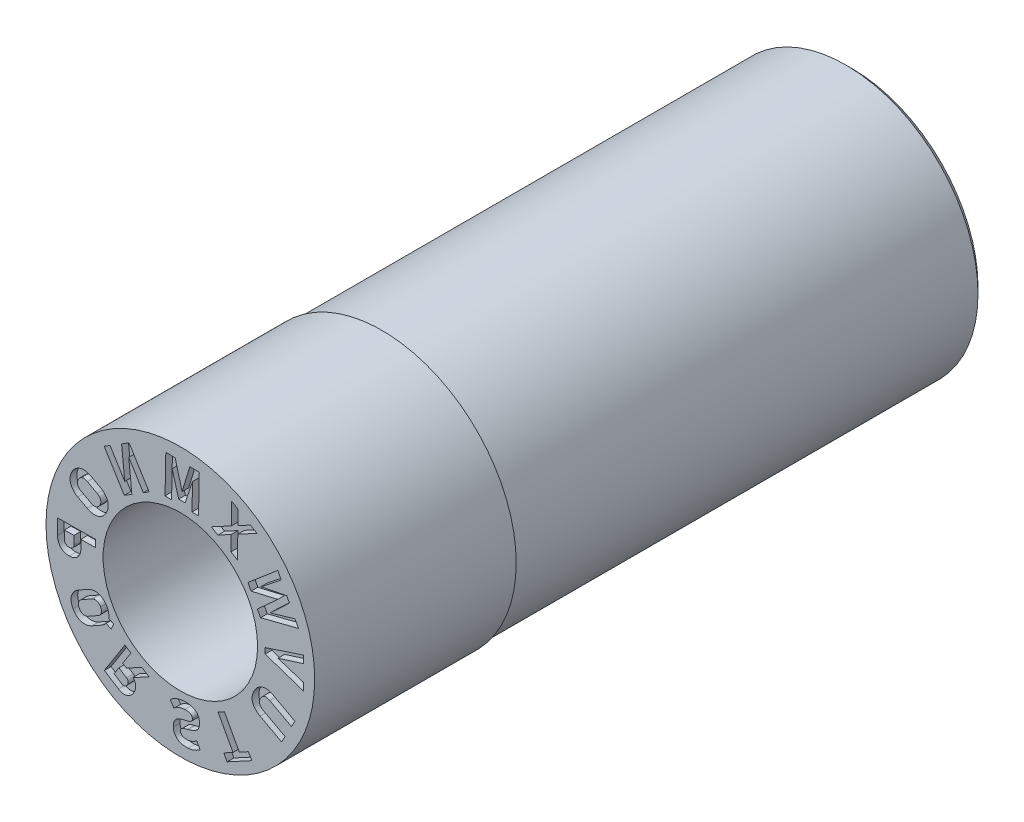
from build123d import *

# Parameters (mm, degrees)
SKETCH4_W          = 14
SKETCH4_H          = 1
CUT_EXTRUDE1_DEPTH = 0.2
CUT_EXTRUDE2_DEPTH = 2


with BuildPart() as part:
    # Sketch1 → Revolve1 (revolve)
    with BuildSketch(Plane(origin=(0, 0, 0), x_dir=(0, 0, -1), z_dir=(1, 0, 0)), mode=Mode.PRIVATE) as revolve1_sk:
        Polygon((0, 4), (0, 2.3), (4, 2.3), (4, 1.25), (16, 1.25), (16, 2), (20, 2), (20, 3.75), (19.75, 4), align=None)
    revolve(revolve1_sk.sketch.rotate(Axis((0, 0, 3.797909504), (0, 0, -1)), 90), axis=Axis((0, 0, 3.797909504), (0, 0, -1)))

    # Sketch4 → Cut-Revolve1 (revolve, cut)
    with BuildSketch(Plane(origin=(0, 0, 0), x_dir=(0, 0, -1), z_dir=(1, 0, 0)), mode=Mode.PRIVATE) as cut_revolve1_sk:
        with Locations((13, 4.435)):
            Rectangle(SKETCH4_W, SKETCH4_H)
    revolve(cut_revolve1_sk.sketch.rotate(Axis((0, 0, 0), (0, 0, -1)), 90), axis=Axis((0, 0, 0), (0, 0, -1)), mode=Mode.SUBTRACT)

    # Sketch2 → Cut-Extrude1 (cut)
    # profile 1 of 12: a face of its own
    with BuildSketch(Plane.XY):
        Polygon((3.247804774, 1.588718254), (3.169033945, 1.741192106), (2.397450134, 1.586364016), (3.002485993, 2.063389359), (2.901481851, 2.258785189), (2.014024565, 1.505693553), (2.106452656, 1.326955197), (2.902854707, 1.512122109), (2.295664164, 0.96124389), (2.388092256, 0.782505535), (3.515356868, 1.071125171), (3.414352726, 1.266521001), (2.675325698, 1.048588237), align=None)
    # profile 2 of 12: a face of its own
    with BuildSketch(Plane.XY):
        Polygon((1.710269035, 2.597164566), (2.280539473, 2.904238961), (2.087290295, 3.020852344), (1.713110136, 2.819309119), (1.718723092, 3.243002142), (1.524956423, 3.359609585), (1.516835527, 2.71338102), (0.923347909, 2.394496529), (1.117114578, 2.277889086), (1.514030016, 2.491840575), (1.508300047, 2.042128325), (1.701860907, 1.925415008), align=None)
    # profile 3 of 12: a face of its own
    with BuildSketch(Plane.XY):
        Polygon((-0.151044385, 3.633643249), (-0.43317933, 3.639194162), (-0.455208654, 2.503466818), (-0.260554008, 2.499811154), (-0.244881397, 3.305667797), (-0.048788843, 2.622169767), (0.140306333, 2.61850596), (0.362646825, 3.280620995), (0.347229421, 2.48788663), (0.54165281, 2.484240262), (0.563682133, 3.619967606), (0.28176915, 3.625277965), (0.050580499, 2.864167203), align=None)
    # profile 4 of 12: a face of its own
    with BuildSketch(Plane.XY):
        with BuildLine():
            Line((-2.964012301, 0.128344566), (-2.5234433, 0.131972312))
            Line((-2.5234433, 0.131972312), (-2.525230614, 0.346058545))
            Line((-2.525230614, 0.346058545), (-3.660931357, 0.336706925))
            Line((-3.660931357, 0.336706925), (-3.657123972, -0.11877592))
            add(Edge.make_bspline(
                [(-3.657123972, -0.11877592), (-3.656719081, -0.152278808), (-3.651710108, -0.201746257), (-3.632607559, -0.263687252), (-3.613347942, -0.3057356), (-3.589117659, -0.343832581), (-3.560216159, -0.377517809), (-3.52701986, -0.406735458), (-3.489294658, -0.430844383), (-3.447970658, -0.450072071), (-3.387116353, -0.468798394), (-3.338526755, -0.472794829), (-3.305742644, -0.472750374)],
                knots=[0, 0, 0, 0, 0.179221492, 0.263355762, 0.345299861, 0.425606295, 0.50376529, 0.581676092, 0.661013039, 0.742124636, 0.824502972, 1, 1, 1, 1], degree=3))
            add(Edge.make_bspline(
                [(-3.305742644, -0.472750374), (-3.273001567, -0.47241053), (-3.224638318, -0.467396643), (-3.164366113, -0.447589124), (-3.123668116, -0.42759382), (-3.086502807, -0.402916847), (-3.053913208, -0.373180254), (-3.025934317, -0.338856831), (-3.002559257, -0.300441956), (-2.98394769, -0.258213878), (-2.966057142, -0.195976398), (-2.962057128, -0.146456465), (-2.962095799, -0.112979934)],
                knots=[0, 0, 0, 0, 0.175635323, 0.257844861, 0.338626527, 0.417827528, 0.495999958, 0.573987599, 0.654232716, 0.736138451, 0.82044396, 1, 1, 1, 1], degree=3))
            Line((-2.962095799, -0.112979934), (-2.964012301, 0.128344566))
        make_face()
        with BuildLine():
            Line((-3.452807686, 0.124319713), (-3.170212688, 0.126646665))
            Line((-3.170212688, 0.126646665), (-3.168219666, -0.120187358))
            add(Edge.make_bspline(
                [(-3.168219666, -0.120187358), (-3.167953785, -0.132361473), (-3.16993381, -0.150269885), (-3.177049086, -0.172800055), (-3.184858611, -0.187977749), (-3.194165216, -0.202127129), (-3.205856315, -0.214453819), (-3.219067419, -0.225488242), (-3.234368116, -0.234358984), (-3.250805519, -0.242008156), (-3.275288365, -0.248801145), (-3.294491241, -0.251294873), (-3.307659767, -0.251027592)],
                knots=[0, 0, 0, 0, 0.169701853, 0.249372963, 0.328349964, 0.407202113, 0.484869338, 0.564569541, 0.646563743, 0.730961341, 0.816890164, 1, 1, 1, 1], degree=3))
            add(Edge.make_bspline(
                [(-3.307659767, -0.251027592), (-3.320887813, -0.250923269), (-3.340638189, -0.249910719), (-3.365389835, -0.242851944), (-3.382417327, -0.236171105), (-3.397717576, -0.22721379), (-3.411477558, -0.21690812), (-3.423105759, -0.20452116), (-3.433189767, -0.190912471), (-3.440806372, -0.175554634), (-3.448543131, -0.152996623), (-3.450794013, -0.134812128), (-3.450815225, -0.122444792)],
                knots=[0, 0, 0, 0, 0.18385166, 0.270697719, 0.355396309, 0.436349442, 0.515406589, 0.59249156, 0.670707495, 0.749039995, 0.82874369, 1, 1, 1, 1], degree=3))
            Line((-3.450815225, -0.122444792), (-3.452807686, 0.124319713))
        make_face(mode=Mode.SUBTRACT)
    # profile 5 of 12: a face of its own
    with BuildSketch(Plane.XY):
        Polygon((-1.527782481, 3.334069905), (-1.750283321, 3.195930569), (-1.654729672, 2.276475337), (-2.093350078, 2.982880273), (-2.267497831, 2.874848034), (-1.668522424, 1.910222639), (-1.444763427, 2.049271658), (-1.534862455, 2.957598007), (-1.10264255, 2.26151033), (-0.928807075, 2.36944451), align=None)
    # profile 6 of 12: a face of its own
    with BuildSketch(Plane.XY):
        with BuildLine():
            Line((-1.716430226, -2.443160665), (-1.470723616, -2.05780505))
            Line((-1.470723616, -2.05780505), (-1.65124668, -1.942761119))
            Line((-1.65124668, -1.942761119), (-2.262593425, -2.901570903))
            Line((-2.262593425, -2.901570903), (-1.842861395, -3.169117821))
            add(Edge.make_bspline(
                [(-1.842861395, -3.169117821), (-1.817777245, -3.18487524), (-1.778443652, -3.204688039), (-1.722656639, -3.219019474), (-1.681349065, -3.223328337), (-1.640276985, -3.221838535), (-1.600039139, -3.214218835), (-1.560909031, -3.200956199), (-1.523163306, -3.181693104), (-1.487284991, -3.156888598), (-1.441072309, -3.115988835), (-1.412484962, -3.078187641), (-1.395011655, -3.051363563)],
                knots=[0, 0, 0, 0, 0.170698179, 0.250923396, 0.330224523, 0.408886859, 0.486576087, 0.565054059, 0.645850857, 0.729605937, 0.815425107, 1, 1, 1, 1], degree=3))
            add(Edge.make_bspline(
                [(-1.395011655, -3.051363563), (-1.377872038, -3.024384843), (-1.356143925, -2.982449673), (-1.338330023, -2.923504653), (-1.331352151, -2.880442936), (-1.329767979, -2.838049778), (-1.334061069, -2.79683332), (-1.344506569, -2.757148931), (-1.36064181, -2.719274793), (-1.381604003, -2.684468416), (-1.398418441, -2.663466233), (-1.407179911, -2.653888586)],
                knots=[0, 0, 0, 0, 0.184208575, 0.27000488, 0.353629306, 0.43476035, 0.513647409, 0.591381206, 0.670203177, 0.74994269, 0.824656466, 0.824656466, 0.824656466, 0.824656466], degree=3))
            Line((-1.407179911, -2.653888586), (-0.926349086, -2.40488813))
            Line((-0.926349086, -2.40488813), (-1.145199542, -2.265419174))
            Line((-1.145199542, -2.265419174), (-1.606772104, -2.513094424))
            Line((-1.606772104, -2.513094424), (-1.716430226, -2.443160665))
        make_face()
        with BuildLine():
            Line((-1.827339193, -2.617105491), (-1.602683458, -2.760403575))
            add(Edge.make_bspline(
                [(-1.602683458, -2.760403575), (-1.594000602, -2.76609044), (-1.581707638, -2.775724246), (-1.569636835, -2.792148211), (-1.562397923, -2.805174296), (-1.557440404, -2.819260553), (-1.554298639, -2.834173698), (-1.553747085, -2.849875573), (-1.555139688, -2.8661336), (-1.558481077, -2.8827766), (-1.566095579, -2.905611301), (-1.574434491, -2.922123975), (-1.580936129, -2.93282994)],
                knots=[0, 0, 0, 0, 0.160556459, 0.236528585, 0.312593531, 0.389213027, 0.465583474, 0.546397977, 0.630136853, 0.716407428, 0.807127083, 1, 1, 1, 1], degree=3))
            add(Edge.make_bspline(
                [(-1.580936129, -2.93282994), (-1.587962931, -2.943190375), (-1.598693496, -2.958413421), (-1.616522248, -2.974663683), (-1.629890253, -2.985093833), (-1.644094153, -2.992884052), (-1.658368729, -2.999071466), (-1.673133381, -3.002491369), (-1.688050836, -3.003918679), (-1.702991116, -3.002764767), (-1.723155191, -2.998371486), (-1.737338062, -2.991349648), (-1.746360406, -2.985797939)],
                knots=[0, 0, 0, 0, 0.19302199, 0.282996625, 0.369659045, 0.452649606, 0.531050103, 0.607759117, 0.684303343, 0.760277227, 0.836867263, 1, 1, 1, 1], degree=3))
            Line((-1.746360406, -2.985797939), (-1.971042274, -2.842483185))
            Line((-1.971042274, -2.842483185), (-1.827339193, -2.617105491))
        make_face(mode=Mode.SUBTRACT)
    # profile 7 of 12: a face of its own
    with BuildSketch(Plane.XY):
        with BuildLine():
            Line((-2.37686849, 1.75345038), (-2.659973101, 1.90634487))
            add(Edge.make_bspline(
                [(-2.659973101, 1.90634487), (-2.677804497, 1.915958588), (-2.70486696, 1.928998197), (-2.742000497, 1.942536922), (-2.769310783, 1.950974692), (-2.796597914, 1.957501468), (-2.823770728, 1.962154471), (-2.850896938, 1.965023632), (-2.877919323, 1.965701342), (-2.904620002, 1.964900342), (-2.930847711, 1.961861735), (-2.956451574, 1.957131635), (-2.981690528, 1.951149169), (-3.006198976, 1.942642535), (-3.030279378, 1.932744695), (-3.053804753, 1.920939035), (-3.076610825, 1.907342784), (-3.098683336, 1.892063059), (-3.119814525, 1.875092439), (-3.140089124, 1.856707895), (-3.158957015, 1.836297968), (-3.17723013, 1.814750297), (-3.200536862, 1.783404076), (-3.215585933, 1.757833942), (-3.225282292, 1.74037232)],
                knots=[0, 0, 0, 0, 0.091587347, 0.135450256, 0.178530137, 0.220707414, 0.262153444, 0.303048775, 0.343866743, 0.384229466, 0.423679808, 0.463053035, 0.501869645, 0.540770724, 0.580159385, 0.619472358, 0.659607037, 0.700066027, 0.740692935, 0.78202147, 0.823628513, 0.866208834, 0.909670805, 1, 1, 1, 1], degree=3))
            add(Edge.make_bspline(
                [(-3.225282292, 1.74037232), (-3.234715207, 1.722713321), (-3.247492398, 1.695913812), (-3.260930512, 1.659236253), (-3.269429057, 1.63227757), (-3.27540836, 1.605140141), (-3.279944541, 1.578168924), (-3.282591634, 1.551162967), (-3.283098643, 1.52426907), (-3.282042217, 1.497661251), (-3.279014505, 1.471486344), (-3.274500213, 1.445798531), (-3.267634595, 1.420766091), (-3.25942932, 1.396160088), (-3.249169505, 1.37215668), (-3.237131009, 1.348699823), (-3.223266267, 1.325883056), (-3.207691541, 1.30382654), (-3.190508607, 1.282626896), (-3.171606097, 1.262543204), (-3.151559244, 1.242903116), (-3.129241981, 1.2249792), (-3.097511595, 1.201458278), (-3.071757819, 1.186037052), (-3.054036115, 1.176305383)],
                knots=[0, 0, 0, 0, 0.090472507, 0.133829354, 0.176400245, 0.218055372, 0.259247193, 0.299906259, 0.340508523, 0.380674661, 0.420108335, 0.459464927, 0.49836987, 0.537254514, 0.576563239, 0.616167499, 0.656271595, 0.697072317, 0.738063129, 0.7794315, 0.82161976, 0.864719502, 0.908610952, 1, 1, 1, 1], degree=3))
            Line((-3.054036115, 1.176305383), (-2.770931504, 1.023410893))
            add(Edge.make_bspline(
                [(-2.770931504, 1.023410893), (-2.753100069, 1.01379758), (-2.726037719, 1.000756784), (-2.688904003, 0.987219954), (-2.661594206, 0.97877701), (-2.634305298, 0.972269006), (-2.607079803, 0.967537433), (-2.579869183, 0.964919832), (-2.552791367, 0.964147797), (-2.526062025, 0.965057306), (-2.499770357, 0.967773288), (-2.474132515, 0.972472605), (-2.448950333, 0.978911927), (-2.424314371, 0.9869709), (-2.400308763, 0.997282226), (-2.376775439, 1.009019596), (-2.353906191, 1.022668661), (-2.331839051, 1.037950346), (-2.310683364, 1.054899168), (-2.290516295, 1.073358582), (-2.27128506, 1.093439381), (-2.253381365, 1.115310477), (-2.229924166, 1.146556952), (-2.214960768, 1.172200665), (-2.205235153, 1.189637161)],
                knots=[0, 0, 0, 0, 0.091523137, 0.135355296, 0.178404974, 0.220552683, 0.261969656, 0.303107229, 0.34389658, 0.384231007, 0.423811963, 0.463157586, 0.501832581, 0.541131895, 0.580086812, 0.619718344, 0.659824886, 0.700255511, 0.740853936, 0.782153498, 0.823650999, 0.866302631, 0.909734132, 1, 1, 1, 1], degree=3))
            add(Edge.make_bspline(
                [(-2.205235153, 1.189637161), (-2.195776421, 1.207288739), (-2.183074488, 1.234109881), (-2.16953713, 1.270697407), (-2.161361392, 1.29774491), (-2.15505019, 1.324797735), (-2.150590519, 1.351844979), (-2.147922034, 1.378845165), (-2.147416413, 1.405741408), (-2.148488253, 1.432345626), (-2.151442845, 1.458431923), (-2.156157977, 1.483978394), (-2.162936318, 1.509004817), (-2.171264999, 1.533568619), (-2.181427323, 1.557608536), (-2.193493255, 1.581056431), (-2.207403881, 1.6039333), (-2.223013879, 1.626062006), (-2.240221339, 1.647235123), (-2.259045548, 1.667430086), (-2.279435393, 1.686688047), (-2.301395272, 1.705075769), (-2.333539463, 1.728060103), (-2.359058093, 1.743835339), (-2.37686849, 1.75345038)],
                knots=[0, 0, 0, 0, 0.090475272, 0.133833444, 0.176138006, 0.218045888, 0.259238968, 0.299899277, 0.340502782, 0.380670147, 0.420105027, 0.459006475, 0.497912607, 0.537135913, 0.576102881, 0.615708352, 0.656161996, 0.696963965, 0.73795603, 0.779325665, 0.821594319, 0.864592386, 0.908608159, 1, 1, 1, 1], degree=3))
        make_face()
        with BuildLine():
            Line((-2.660604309, 1.216082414), (-2.953489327, 1.374189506))
            add(Edge.make_bspline(
                [(-2.953489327, 1.374189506), (-2.970150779, 1.382781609), (-2.99295505, 1.398587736), (-3.018841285, 1.423941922), (-3.034723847, 1.444337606), (-3.047419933, 1.466117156), (-3.056543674, 1.489077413), (-3.062561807, 1.51296585), (-3.06442591, 1.537678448), (-3.063113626, 1.562915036), (-3.056249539, 1.597582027), (-3.04579238, 1.622599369), (-3.037164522, 1.638682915)],
                knots=[0, 0, 0, 0, 0.179548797, 0.264318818, 0.346736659, 0.426787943, 0.505309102, 0.583020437, 0.662166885, 0.742098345, 0.824788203, 1, 1, 1, 1], degree=3))
            add(Edge.make_bspline(
                [(-3.037164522, 1.638682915), (-3.028321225, 1.654496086), (-3.013507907, 1.67707463), (-2.988163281, 1.70160908), (-2.967842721, 1.716613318), (-2.945990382, 1.728559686), (-2.922763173, 1.736704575), (-2.898518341, 1.741704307), (-2.873391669, 1.743103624), (-2.8476642, 1.741106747), (-2.812266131, 1.733344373), (-2.786642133, 1.722690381), (-2.770106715, 1.713800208)],
                knots=[0, 0, 0, 0, 0.174369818, 0.256577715, 0.337423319, 0.416207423, 0.494702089, 0.572815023, 0.653098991, 0.735460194, 0.819772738, 1, 1, 1, 1], degree=3))
            Line((-2.770106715, 1.713800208), (-2.477221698, 1.555693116))
            add(Edge.make_bspline(
                [(-2.477221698, 1.555693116), (-2.460546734, 1.546977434), (-2.437770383, 1.531168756), (-2.411804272, 1.505896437), (-2.396010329, 1.48553363), (-2.383211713, 1.463781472), (-2.374440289, 1.440739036), (-2.368454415, 1.416912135), (-2.366651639, 1.392210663), (-2.367729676, 1.366899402), (-2.374673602, 1.332282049), (-2.384989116, 1.307342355), (-2.393673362, 1.291393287)],
                knots=[0, 0, 0, 0, 0.180400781, 0.264533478, 0.34703583, 0.427169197, 0.505920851, 0.583013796, 0.6622414, 0.742852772, 0.82562742, 1, 1, 1, 1], degree=3))
            add(Edge.make_bspline(
                [(-2.393673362, 1.291393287), (-2.402254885, 1.275300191), (-2.417543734, 1.252985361), (-2.442856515, 1.228335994), (-2.463184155, 1.213314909), (-2.485054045, 1.201484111), (-2.50805683, 1.192959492), (-2.532277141, 1.188228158), (-2.557318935, 1.186749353), (-2.58308919, 1.18884501), (-2.618582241, 1.196210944), (-2.64414356, 1.20719472), (-2.660604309, 1.216082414)],
                knots=[0, 0, 0, 0, 0.175118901, 0.257326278, 0.33817137, 0.416954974, 0.49527777, 0.572702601, 0.652986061, 0.735346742, 0.820180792, 1, 1, 1, 1], degree=3))
        make_face(mode=Mode.SUBTRACT)
    # profile 8 of 12: a face of its own
    with BuildSketch(Plane.XY):
        Polygon((1.567445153, -3.101754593), (1.294563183, -3.249658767), (1.39313191, -3.431503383), (2.12726231, -3.033598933), (2.028693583, -2.851754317), (1.756032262, -2.999538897), (1.311931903, -2.180061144), (1.123335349, -2.282259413), align=None)
    # profile 9 of 12: a face of its own
    with BuildSketch(Plane.XY):
        with BuildLine():
            Line((-2.211031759, -1.663965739), (-2.055115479, -1.731615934))
            Line((-2.055115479, -1.731615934), (-1.984836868, -1.5618037))
            Line((-1.984836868, -1.5618037), (-2.133633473, -1.49744289))
            add(Edge.make_bspline(
                [(-2.133633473, -1.49744289), (-2.132607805, -1.491754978), (-2.130318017, -1.477495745), (-2.127920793, -1.454301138), (-2.127471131, -1.427824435), (-2.128581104, -1.401022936), (-2.131614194, -1.374195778), (-2.136557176, -1.347389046), (-2.142961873, -1.320466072), (-2.151909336, -1.293681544), (-2.165873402, -1.257392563), (-2.17919508, -1.231045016), (-2.188814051, -1.213670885)],
                knots=[0.553405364, 0.553405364, 0.553405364, 0.553405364, 0.579646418, 0.618973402, 0.659169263, 0.699784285, 0.740710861, 0.781644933, 0.823509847, 0.866258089, 0.909768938, 1, 1, 1, 1], degree=3))
            add(Edge.make_bspline(
                [(-2.188814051, -1.213670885), (-2.198526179, -1.196307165), (-2.21460113, -1.171554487), (-2.2379003, -1.140528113), (-2.256374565, -1.119320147), (-2.275824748, -1.099734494), (-2.296246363, -1.081725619), (-2.317617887, -1.065265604), (-2.339849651, -1.050479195), (-2.362954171, -1.037439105), (-2.386437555, -1.025845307), (-2.410494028, -1.016213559), (-2.435077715, -1.008516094), (-2.460207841, -1.002556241), (-2.485921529, -0.998368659), (-2.512120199, -0.996294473), (-2.538702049, -0.995580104), (-2.565528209, -0.997104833), (-2.592530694, -0.999913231), (-2.619393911, -1.005448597), (-2.646515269, -1.011937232), (-2.67343074, -1.02119591), (-2.71016936, -1.035109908), (-2.736743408, -1.048796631), (-2.754296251, -1.058566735)],
                knots=[0, 0, 0, 0, 0.09030825, 0.133907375, 0.176133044, 0.217948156, 0.259195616, 0.299711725, 0.340383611, 0.380355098, 0.420138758, 0.459254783, 0.497924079, 0.537040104, 0.576475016, 0.616122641, 0.656328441, 0.697150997, 0.738087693, 0.779503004, 0.821628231, 0.864654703, 0.908667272, 1, 1, 1, 1], degree=3))
            Line((-2.754296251, -1.058566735), (-3.033466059, -1.215850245))
            add(Edge.make_bspline(
                [(-3.033466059, -1.215850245), (-3.051157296, -1.225562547), (-3.07613588, -1.241965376), (-3.107758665, -1.265379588), (-3.129260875, -1.284072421), (-3.149171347, -1.303582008), (-3.167550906, -1.324034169), (-3.18424295, -1.345454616), (-3.199339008, -1.367758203), (-3.212704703, -1.390689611), (-3.224103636, -1.414331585), (-3.234199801, -1.438262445), (-3.241831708, -1.462917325), (-3.247993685, -1.487942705), (-3.252245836, -1.513438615), (-3.254979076, -1.539487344), (-3.255398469, -1.565963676), (-3.254372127, -1.592714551), (-3.251057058, -1.619442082), (-3.24635059, -1.646239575), (-3.239324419, -1.672944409), (-3.23081887, -1.699802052), (-3.216620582, -1.735947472), (-3.203886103, -1.762556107), (-3.193831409, -1.779724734)],
                knots=[0, 0, 0, 0, 0.0915477, 0.135593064, 0.17858496, 0.220816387, 0.262117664, 0.303360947, 0.34403936, 0.384343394, 0.423771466, 0.463168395, 0.502170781, 0.540838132, 0.580133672, 0.619463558, 0.659662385, 0.700280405, 0.740934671, 0.781871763, 0.823745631, 0.866230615, 0.909744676, 1, 1, 1, 1], degree=3))
            add(Edge.make_bspline(
                [(-3.193831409, -1.779724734), (-3.183827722, -1.796919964), (-3.168466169, -1.822188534), (-3.144555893, -1.852877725), (-3.12635324, -1.874297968), (-3.106899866, -1.893928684), (-3.086461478, -1.91180399), (-3.065328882, -1.928586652), (-3.04302444, -1.94329165), (-3.01993906, -1.95636056), (-2.996443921, -1.967924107), (-2.972327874, -1.977681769), (-2.947645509, -1.985036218), (-2.922602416, -1.991321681), (-2.896961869, -1.995399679), (-2.870768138, -1.997507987), (-2.844189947, -1.998180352), (-2.817296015, -1.996788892), (-2.790318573, -1.993463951), (-2.763233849, -1.988752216), (-2.736347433, -1.981360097), (-2.709141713, -1.972985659), (-2.672752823, -1.957999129), (-2.645707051, -1.945321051), (-2.628273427, -1.9351473)],
                knots=[0, 0, 0, 0, 0.090397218, 0.133844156, 0.176483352, 0.217932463, 0.259154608, 0.299683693, 0.340330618, 0.380277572, 0.420036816, 0.459128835, 0.498200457, 0.536850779, 0.576261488, 0.615884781, 0.656065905, 0.696863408, 0.737991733, 0.779405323, 0.821513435, 0.864473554, 0.908528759, 1, 1, 1, 1], degree=3))
            Line((-2.628273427, -1.9351473), (-2.349103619, -1.77786379))
            add(Edge.make_bspline(
                [(-2.349103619, -1.77786379), (-2.331474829, -1.76806846), (-2.306336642, -1.751924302), (-2.27502739, -1.728139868), (-2.25356775, -1.709568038), (-2.233588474, -1.690120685), (-2.219788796, -1.674649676), (-2.212490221, -1.66577065), (-2.211031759, -1.663965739)],
                knots=[0, 0, 0, 0, 0.091540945, 0.135456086, 0.178444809, 0.22033317, 0.261976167, 0.272511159, 0.272511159, 0.272511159, 0.272511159], degree=3))
        make_face()
        with BuildLine():
            Line((-2.452917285, -1.582698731), (-2.741276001, -1.745197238))
            add(Edge.make_bspline(
                [(-2.741276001, -1.745197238), (-2.75750374, -1.754631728), (-2.783041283, -1.765391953), (-2.818218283, -1.773704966), (-2.843802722, -1.776261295), (-2.868756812, -1.77544386), (-2.892787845, -1.770718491), (-2.915994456, -1.763236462), (-2.937881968, -1.751722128), (-2.958478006, -1.737279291), (-2.983669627, -1.712782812), (-2.999688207, -1.691242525), (-3.008264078, -1.675167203)],
                knots=[0, 0, 0, 0, 0.180720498, 0.265411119, 0.347688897, 0.427964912, 0.505194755, 0.583144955, 0.662222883, 0.74273294, 0.82487609, 1, 1, 1, 1], degree=3))
            add(Edge.make_bspline(
                [(-3.008264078, -1.675167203), (-3.017059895, -1.659297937), (-3.028172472, -1.634727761), (-3.035432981, -1.600322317), (-3.037214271, -1.575263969), (-3.035445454, -1.550619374), (-3.03035823, -1.526695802), (-3.021683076, -1.503726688), (-3.009558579, -1.481906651), (-2.994162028, -1.461406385), (-2.968889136, -1.435585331), (-2.946030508, -1.419877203), (-2.929728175, -1.410696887)],
                knots=[0, 0, 0, 0, 0.175313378, 0.257397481, 0.337905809, 0.416761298, 0.494872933, 0.572924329, 0.65260705, 0.734772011, 0.819411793, 1, 1, 1, 1], degree=3))
            Line((-2.929728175, -1.410696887), (-2.641369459, -1.24819838))
            add(Edge.make_bspline(
                [(-2.641369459, -1.24819838), (-2.624982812, -1.239337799), (-2.599885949, -1.227589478), (-2.564671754, -1.219844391), (-2.539162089, -1.217169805), (-2.514121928, -1.218108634), (-2.490013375, -1.222518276), (-2.466914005, -1.230353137), (-2.445053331, -1.241707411), (-2.42452603, -1.256319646), (-2.398725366, -1.280271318), (-2.383612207, -1.302670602), (-2.374381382, -1.318228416)],
                knots=[0, 0, 0, 0, 0.180299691, 0.264511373, 0.346830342, 0.427146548, 0.505376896, 0.582473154, 0.661590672, 0.742141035, 0.824902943, 1, 1, 1, 1], degree=3))
            add(Edge.make_bspline(
                [(-2.374381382, -1.318228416), (-2.365262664, -1.333976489), (-2.354938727, -1.358799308), (-2.347482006, -1.393143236), (-2.345846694, -1.418237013), (-2.347177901, -1.44285598), (-2.352585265, -1.466659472), (-2.361167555, -1.48962425), (-2.373373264, -1.511494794), (-2.388787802, -1.53207999), (-2.414072, -1.557739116), (-2.43648395, -1.573853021), (-2.452917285, -1.582698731)],
                knots=[0, 0, 0, 0, 0.175358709, 0.257515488, 0.338095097, 0.417367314, 0.494599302, 0.572719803, 0.653216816, 0.735454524, 0.820169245, 1, 1, 1, 1], degree=3))
        make_face(mode=Mode.SUBTRACT)
    # profile 10 of 12: a face of its own
    with BuildSketch(Plane.XY):
        with BuildLine():
            Line((-0.300560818, -2.669763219), (-0.191248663, -2.840418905))
            add(Edge.make_bspline(
                [(-0.191248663, -2.840418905), (-0.170402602, -2.820926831), (-0.135702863, -2.795149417), (-0.085343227, -2.766309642), (-0.044661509, -2.748170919), (-0.002497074, -2.732811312), (0.055440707, -2.717183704), (0.100077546, -2.710951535), (0.130017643, -2.709258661)],
                knots=[0, 0, 0, 0, 0.241701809, 0.365363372, 0.491604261, 0.619060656, 0.745694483, 1, 1, 1, 1], degree=3))
            add(Edge.make_bspline(
                [(0.130017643, -2.709258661), (0.146490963, -2.708106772), (0.170600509, -2.707926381), (0.20178723, -2.709639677), (0.223134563, -2.712335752), (0.243053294, -2.716292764), (0.261603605, -2.721408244), (0.278850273, -2.727409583), (0.294513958, -2.734954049), (0.30876334, -2.743312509), (0.320952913, -2.753225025), (0.331836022, -2.763638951), (0.340431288, -2.775553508), (0.347713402, -2.788155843), (0.355091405, -2.806834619), (0.357116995, -2.822060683), (0.357958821, -2.832287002)],
                knots=[0, 0, 0, 0, 0.170595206, 0.248995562, 0.322696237, 0.392819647, 0.458721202, 0.521499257, 0.581267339, 0.638207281, 0.69178075, 0.743346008, 0.793403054, 0.84303907, 0.893538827, 1, 1, 1, 1], degree=3))
            add(Edge.make_bspline(
                [(0.357958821, -2.832287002), (0.359115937, -2.846727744), (0.357142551, -2.867008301), (0.347597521, -2.891534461), (0.336862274, -2.906934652), (0.323404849, -2.919957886), (0.308142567, -2.931779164), (0.290701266, -2.941612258), (0.271074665, -2.94995175), (0.249031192, -2.957155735), (0.214263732, -2.967338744), (0.186412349, -2.973735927), (0.16685811, -2.977915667)],
                knots=[0, 0, 0, 0, 0.155433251, 0.226357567, 0.294959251, 0.365572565, 0.437141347, 0.512415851, 0.590942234, 0.677592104, 0.774135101, 1, 1, 1, 1], degree=3))
            add(Edge.make_bspline(
                [(0.16685811, -2.977915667), (0.165451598, -2.978360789), (0.16260607, -2.979349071), (0.159574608, -2.979172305), (0.158228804, -2.979970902)],
                knots=[0, 0, 0, 0, 0.500720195, 1, 1, 1, 1], degree=3))
            Line((0.158228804, -2.979970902), (0.141129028, -2.983366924))
            add(Edge.make_bspline(
                [(0.141129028, -2.983366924), (0.106448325, -2.990562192), (0.057114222, -3.0032007), (-0.004652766, -3.023100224), (-0.044565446, -3.038155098), (-0.08075795, -3.056262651), (-0.113025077, -3.079750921), (-0.142281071, -3.107904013), (-0.16363498, -3.135157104), (-0.178497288, -3.159489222), (-0.188163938, -3.179682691), (-0.195680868, -3.201720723), (-0.202068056, -3.225224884), (-0.205989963, -3.250489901), (-0.209645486, -3.28733124), (-0.209133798, -3.315940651), (-0.208260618, -3.335451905)],
                knots=[0, 0, 0, 0, 0.190443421, 0.273606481, 0.348892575, 0.419696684, 0.490505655, 0.562626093, 0.637448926, 0.675950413, 0.715796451, 0.75755354, 0.801013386, 0.846607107, 0.894856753, 1, 1, 1, 1], degree=3))
            add(Edge.make_bspline(
                [(-0.208260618, -3.335451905), (-0.207278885, -3.354123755), (-0.203994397, -3.380146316), (-0.197312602, -3.413965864), (-0.190246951, -3.437666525), (-0.182269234, -3.460500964), (-0.172193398, -3.481997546), (-0.161067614, -3.502618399), (-0.148331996, -3.521960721), (-0.134288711, -3.540228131), (-0.118803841, -3.557198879), (-0.10200854, -3.572970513), (-0.083939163, -3.587437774), (-0.064504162, -3.600642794), (-0.043750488, -3.612658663), (-0.02163435, -3.62341626), (0.001740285, -3.632870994), (0.026371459, -3.641036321), (0.052198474, -3.647834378), (0.079078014, -3.653500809), (0.107107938, -3.6575261), (0.136282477, -3.660330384), (0.177533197, -3.662311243), (0.20908667, -3.661929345), (0.230427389, -3.660534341)],
                knots=[0, 0, 0, 0, 0.086084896, 0.127066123, 0.166981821, 0.205903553, 0.244231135, 0.281955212, 0.319431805, 0.356387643, 0.393571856, 0.430697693, 0.467994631, 0.505689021, 0.54452257, 0.584174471, 0.624838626, 0.666694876, 0.709908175, 0.754271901, 0.799816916, 0.847135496, 0.896337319, 1, 1, 1, 1], degree=3))
            add(Edge.make_bspline(
                [(0.230427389, -3.660534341), (0.250983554, -3.659188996), (0.282013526, -3.655840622), (0.3230892, -3.647439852), (0.364932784, -3.636965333), (0.41673173, -3.619417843), (0.497144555, -3.583520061), (0.553307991, -3.547977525), (0.58802887, -3.520732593)],
                knots=[0, 0, 0, 0, 0.158702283, 0.239875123, 0.322724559, 0.490796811, 0.660272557, 1, 1, 1, 1], degree=3))
            Line((0.58802887, -3.520732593), (0.487012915, -3.344798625))
            add(Edge.make_bspline(
                [(0.487012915, -3.344798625), (0.466477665, -3.360867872), (0.434368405, -3.382960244), (0.389088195, -3.407586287), (0.354808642, -3.423555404), (0.320167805, -3.436362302), (0.275221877, -3.449436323), (0.241030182, -3.454439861), (0.218602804, -3.456070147)],
                knots=[0, 0, 0, 0, 0.265378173, 0.395585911, 0.524195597, 0.649874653, 0.771079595, 1, 1, 1, 1], degree=3))
            add(Edge.make_bspline(
                [(0.218602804, -3.456070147), (0.203129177, -3.456962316), (0.180502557, -3.457292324), (0.151175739, -3.455703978), (0.131212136, -3.45303617), (0.112568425, -3.449656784), (0.095224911, -3.44525018), (0.079318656, -3.439340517), (0.064572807, -3.432845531), (0.051349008, -3.425088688), (0.039712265, -3.416320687), (0.029733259, -3.406587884), (0.021580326, -3.395867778), (0.014999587, -3.384345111), (0.008043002, -3.367469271), (0.006019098, -3.353640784), (0.005322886, -3.344323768)],
                knots=[0, 0, 0, 0, 0.17270582, 0.252006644, 0.327088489, 0.397010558, 0.463128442, 0.526196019, 0.585922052, 0.642501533, 0.696643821, 0.747946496, 0.797347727, 0.846237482, 0.895488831, 1, 1, 1, 1], degree=3))
            add(Edge.make_bspline(
                [(0.005322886, -3.344323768), (0.004237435, -3.32874111), (0.00597563, -3.306664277), (0.016764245, -3.280246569), (0.028638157, -3.263957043), (0.042800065, -3.249802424), (0.058828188, -3.237408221), (0.076648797, -3.226826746), (0.09675591, -3.21804808), (0.119709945, -3.209968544), (0.157679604, -3.197521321), (0.188777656, -3.189835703), (0.210698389, -3.18372453)],
                knots=[0, 0, 0, 0, 0.156390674, 0.227184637, 0.295824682, 0.365790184, 0.43611789, 0.507260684, 0.582046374, 0.665244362, 0.761811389, 1, 1, 1, 1], degree=3))
            add(Edge.make_bspline(
                [(0.210698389, -3.18372453), (0.21267749, -3.182964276), (0.216994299, -3.182687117), (0.221036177, -3.1811563), (0.22319381, -3.180804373)],
                knots=[0, 0, 0, 0, 0.490111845, 1, 1, 1, 1], degree=3))
            add(Edge.make_bspline(
                [(0.22319381, -3.180804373), (0.226197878, -3.180189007), (0.232005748, -3.17826491), (0.237813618, -3.176340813), (0.240817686, -3.175725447)],
                knots=[0, 0, 0, 0, 0.5, 1, 1, 1, 1], degree=3))
            add(Edge.make_bspline(
                [(0.240817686, -3.175725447), (0.273583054, -3.167049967), (0.320681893, -3.153868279), (0.379239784, -3.131835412), (0.417406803, -3.115368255), (0.451961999, -3.095980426), (0.482513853, -3.071713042), (0.510005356, -3.04337457), (0.52996889, -3.016391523), (0.543627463, -2.992517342), (0.552302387, -2.972889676), (0.559417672, -2.951817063), (0.565059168, -2.929317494), (0.568732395, -2.905382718), (0.571903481, -2.870720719), (0.571589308, -2.843936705), (0.570638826, -2.825662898)],
                knots=[0, 0, 0, 0, 0.189719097, 0.273146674, 0.349846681, 0.422104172, 0.494063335, 0.567278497, 0.642438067, 0.681118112, 0.720944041, 0.76226868, 0.8054081, 0.850526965, 0.897585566, 1, 1, 1, 1], degree=3))
            Line((0.570638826, -2.825662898), (0.57070249, -2.82402758))
            add(Edge.make_bspline(
                [(0.57070249, -2.82402758), (0.56992488, -2.806501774), (0.566538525, -2.780836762), (0.559369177, -2.747601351), (0.552682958, -2.724118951), (0.543852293, -2.701884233), (0.534165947, -2.680426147), (0.522376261, -2.66029289), (0.509486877, -2.641021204), (0.495061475, -2.622933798), (0.478993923, -2.606146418), (0.461667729, -2.590501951), (0.442776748, -2.576367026), (0.42273271, -2.563225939), (0.401347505, -2.551243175), (0.378387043, -2.540823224), (0.35421569, -2.531451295), (0.328720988, -2.52344811), (0.302081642, -2.516630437), (0.274271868, -2.511076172), (0.245239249, -2.50722138), (0.215073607, -2.504480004), (0.17259251, -2.502637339), (0.14012205, -2.503105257), (0.118169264, -2.50456425)],
                knots=[0, 0, 0, 0, 0.083804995, 0.123524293, 0.162524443, 0.200378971, 0.237826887, 0.274982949, 0.311785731, 0.348623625, 0.385443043, 0.422789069, 0.460113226, 0.498138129, 0.53733493, 0.577192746, 0.618602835, 0.661229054, 0.704880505, 0.750038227, 0.796742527, 0.844853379, 0.894832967, 1, 1, 1, 1], degree=3))
            add(Edge.make_bspline(
                [(0.118169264, -2.50456425), (0.091312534, -2.505782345), (0.051468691, -2.510606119), (-0.001034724, -2.520165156), (-0.039455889, -2.52985269), (-0.077123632, -2.541140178), (-0.113726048, -2.554159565), (-0.149016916, -2.569200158), (-0.182752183, -2.586260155), (-0.215138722, -2.604612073), (-0.255346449, -2.631214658), (-0.283287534, -2.653674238), (-0.300560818, -2.669763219)],
                knots=[0, 0, 0, 0, 0.175587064, 0.262118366, 0.34870697, 0.434464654, 0.519111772, 0.602542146, 0.685065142, 0.766128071, 0.84575847, 1, 1, 1, 1], degree=3))
        make_face()
    # profile 11 of 12: a face of its own
    with BuildSketch(Plane.XY):
        with BuildLine():
            Line((2.375312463, -1.760654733), (3.01466302, -2.106507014))
            Line((3.01466302, -2.106507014), (3.116725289, -1.917836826))
            Line((3.116725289, -1.917836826), (2.472403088, -1.569411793))
            add(Edge.make_bspline(
                [(2.472403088, -1.569411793), (2.458879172, -1.56199096), (2.439618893, -1.550029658), (2.416925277, -1.531224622), (2.401967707, -1.517096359), (2.389624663, -1.501544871), (2.378847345, -1.485534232), (2.370099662, -1.468619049), (2.363421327, -1.450942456), (2.358742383, -1.432737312), (2.35642777, -1.414048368), (2.356088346, -1.395015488), (2.357948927, -1.375653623), (2.361896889, -1.355872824), (2.370107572, -1.328286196), (2.379517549, -1.308193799), (2.38666074, -1.294933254)],
                knots=[0, 0, 0, 0, 0.141710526, 0.207088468, 0.270287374, 0.330096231, 0.38886103, 0.447189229, 0.504398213, 0.561934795, 0.619248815, 0.67680717, 0.736292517, 0.797374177, 0.861646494, 1, 1, 1, 1], degree=3))
            add(Edge.make_bspline(
                [(2.38666074, -1.294933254), (2.393834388, -1.281553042), (2.405886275, -1.262848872), (2.424289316, -1.240413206), (2.439020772, -1.226391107), (2.454136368, -1.213848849), (2.470427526, -1.203702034), (2.487442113, -1.195417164), (2.50522844, -1.189155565), (2.523643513, -1.185000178), (2.542566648, -1.183101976), (2.561911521, -1.182971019), (2.581658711, -1.18520467), (2.601711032, -1.18989012), (2.629935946, -1.198267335), (2.650440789, -1.208054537), (2.664007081, -1.215329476)],
                knots=[0, 0, 0, 0, 0.138735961, 0.203009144, 0.264862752, 0.324470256, 0.382331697, 0.439917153, 0.497247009, 0.554394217, 0.612139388, 0.670854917, 0.731023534, 0.793390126, 0.858978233, 1, 1, 1, 1], degree=3))
            Line((2.664007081, -1.215329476), (3.308329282, -1.563754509))
            Line((3.308329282, -1.563754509), (3.41039155, -1.375084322))
            Line((3.41039155, -1.375084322), (2.771040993, -1.02923204))
            add(Edge.make_bspline(
                [(2.771040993, -1.02923204), (2.7521949, -1.018737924), (2.723312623, -1.005417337), (2.684618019, -0.989810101), (2.656248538, -0.980516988), (2.628197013, -0.973426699), (2.600595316, -0.967837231), (2.573287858, -0.96461908), (2.546342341, -0.96293265), (2.519852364, -0.963241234), (2.493896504, -0.965602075), (2.468541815, -0.96987915), (2.443744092, -0.975983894), (2.419460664, -0.98381781), (2.395913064, -0.993936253), (2.372889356, -1.005760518), (2.350518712, -1.01945166), (2.328700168, -1.034871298), (2.307857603, -1.052315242), (2.287677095, -1.071411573), (2.268513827, -1.092507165), (2.249933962, -1.115191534), (2.22590966, -1.148466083), (2.209907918, -1.175316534), (2.199773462, -1.193922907)],
                knots=[0, 0, 0, 0, 0.095623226, 0.141031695, 0.185088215, 0.227969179, 0.269370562, 0.309960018, 0.349879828, 0.389108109, 0.427391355, 0.465421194, 0.503098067, 0.540631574, 0.578510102, 0.616696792, 0.655395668, 0.694802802, 0.735143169, 0.775899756, 0.817998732, 0.861521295, 0.905960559, 1, 1, 1, 1], degree=3))
            add(Edge.make_bspline(
                [(2.199773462, -1.193922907), (2.18981154, -1.21257719), (2.175883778, -1.240590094), (2.161456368, -1.278951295), (2.152247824, -1.306733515), (2.145640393, -1.334404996), (2.140538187, -1.361596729), (2.137418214, -1.388514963), (2.136390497, -1.415095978), (2.137452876, -1.441255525), (2.139685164, -1.4669875), (2.144845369, -1.492083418), (2.15120905, -1.516694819), (2.159950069, -1.540609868), (2.169924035, -1.564208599), (2.182720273, -1.586862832), (2.196791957, -1.609235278), (2.212709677, -1.630923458), (2.230686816, -1.651686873), (2.250361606, -1.671811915), (2.271750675, -1.691353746), (2.295141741, -1.709850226), (2.329160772, -1.733958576), (2.35637157, -1.750401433), (2.375312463, -1.760654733)],
                knots=[0, 0, 0, 0, 0.094079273, 0.138734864, 0.182121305, 0.22409258, 0.265094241, 0.305054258, 0.344445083, 0.383205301, 0.421398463, 0.459100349, 0.496951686, 0.534302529, 0.572191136, 0.61070019, 0.6497988, 0.689654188, 0.730153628, 0.771787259, 0.81471173, 0.858852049, 0.904259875, 1, 1, 1, 1], degree=3))
        make_face()
    # profile 12 of 12: a face of its own
    with BuildSketch(Plane.XY):
        Polygon((3.661889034, -0.466591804), (3.66256373, -0.246257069), (2.905619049, -0.002930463), (3.66371053, 0.236305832), (3.664385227, 0.456640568), (2.527727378, 0.081813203), (2.527150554, -0.085520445), align=None)
    extrude(amount=-CUT_EXTRUDE1_DEPTH, mode=Mode.SUBTRACT)

    # Sketch3 → Cut-Extrude2 (cut)
    with BuildSketch(Plane.XY.offset(-4)):
        Polygon((0.721687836, 1.25), (-0.721687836, 1.25), (-1.443375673, 0), (-0.721687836, -1.25), (0.721687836, -1.25), (1.443375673, 0), align=None)
    extrude(amount=-CUT_EXTRUDE2_DEPTH, mode=Mode.SUBTRACT)


solid = part.part
